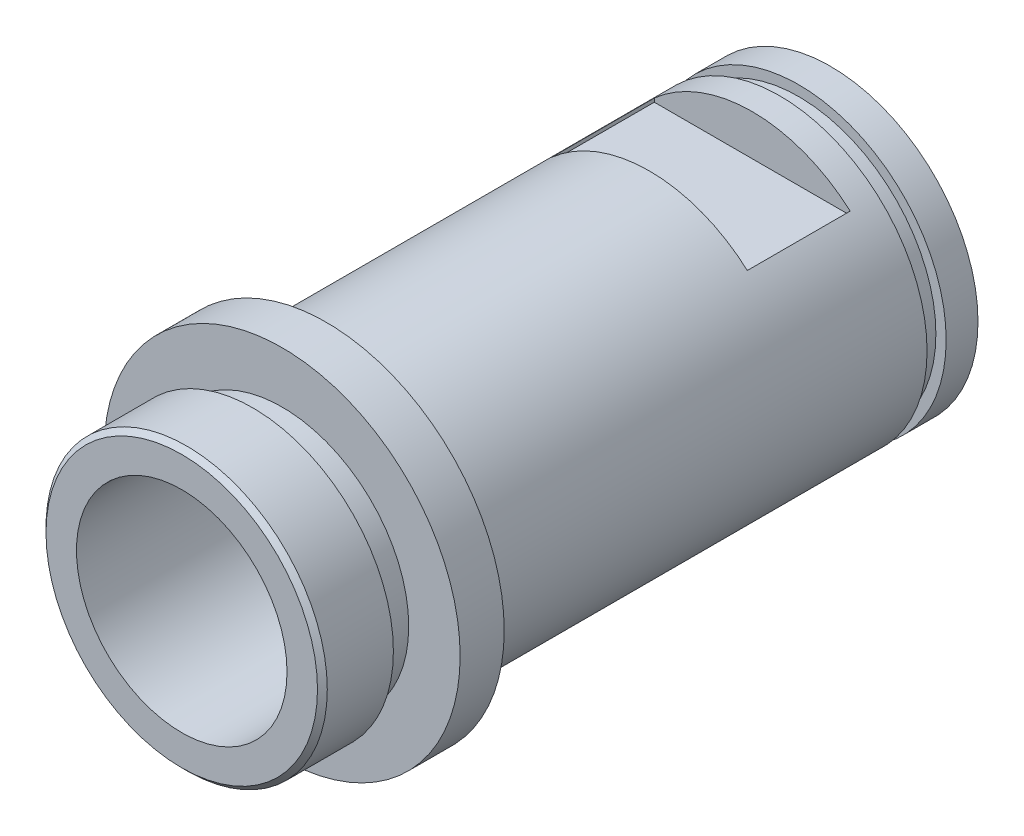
from build123d import *

# Parameters (mm, degrees)
EXTRUDE1_DEPTH      = 5.08
EXTRUDE1_DEPTH_BACK = 5.08
SKETCH2_W           = 5.334
SKETCH2_H           = 3.943481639
SKETCH2_H_2         = 3.648853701
CHAMFER1_SIZE       = 0.254


with BuildPart() as part:
    # Sketch1 → Revolve5 (revolve)
    with BuildSketch(Plane(origin=(0, 0, 0), x_dir=(0, 0, -1), z_dir=(1, 0, 0)), mode=Mode.PRIVATE) as revolve5_sk:
        Polygon((-2.286, 6.5659), (-2.286, 9.2329), (0, 9.2329), (0, 7.6454), (23.5204, 7.6454), (23.5204, 7.112), (24.511, 7.112), (24.511, 7.6454), (26.162, 7.6454), (26.162, 5.461), (-7.493, 5.461), (-7.493, 7.29488), (-3.81, 7.29488), (-3.81, 6.5659), align=None)
    revolve(revolve5_sk.sketch.rotate(Axis((0, 0, 7.493), (0, 0, -1)), 90), axis=Axis((0, 0, 7.493), (0, 0, -1)))

    # Sketch2 → Extrude1 (cut, two sides: drawn at the far end of the back side and taken through both)
    with BuildSketch(Plane(origin=(0, 0, 0), x_dir=(0, 0, -1), z_dir=(1, 0, 0)).offset(-EXTRUDE1_DEPTH_BACK)):
        with Locations((19.431, 7.49624082)):
            Rectangle(SKETCH2_W, SKETCH2_H)
        with Locations((19.431, -7.34892685)):
            Rectangle(SKETCH2_W, SKETCH2_H_2)
    extrude(amount=EXTRUDE1_DEPTH + EXTRUDE1_DEPTH_BACK, mode=Mode.SUBTRACT)

    # Chamfer1
    chamfer1_edges = [part.edges().sort_by_distance(p)[0] for p in [
        (-7.29488, 0, 7.493),
    ]]
    chamfer(chamfer1_edges, length=CHAMFER1_SIZE)


solid = part.part
